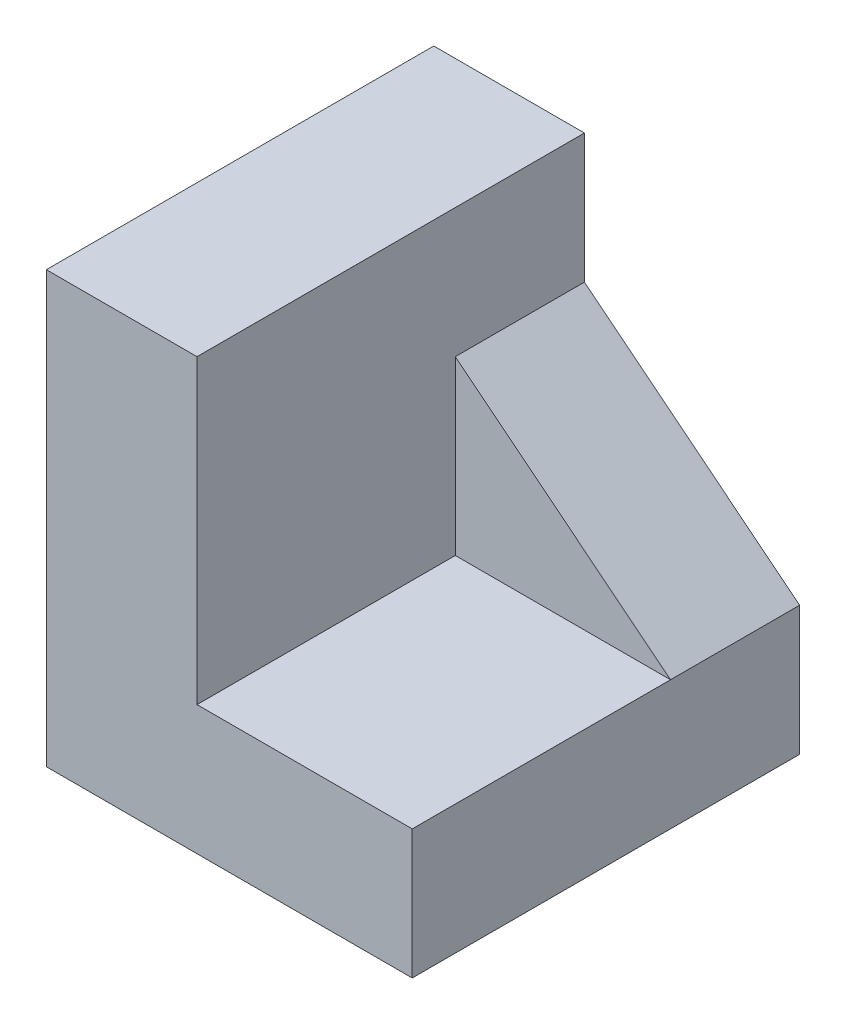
from build123d import *

# Parameters (mm, degrees)
EXTRUDE_1_DEPTH = 36
EXTRUDE_2_DEPTH = 12


with BuildPart() as part:
    # Sketch 1 → Extrude 1 (new body)
    with BuildSketch(Plane.XY):
        Polygon((0, 0), (0, 40), (14, 40), (14, 12), (34, 12), (34, 0), align=None)
    extrude(amount=EXTRUDE_1_DEPTH)

    # Sketch 3 → Extrude 2 (add)
    with BuildSketch(Plane(origin=(0, 0, 0), x_dir=(-1, 0, 0), z_dir=(0, 0, -1))):
        Polygon((-14, 28), (-34, 12), (-14, 12), align=None)
    extrude(amount=-EXTRUDE_2_DEPTH)


solid = part.part
